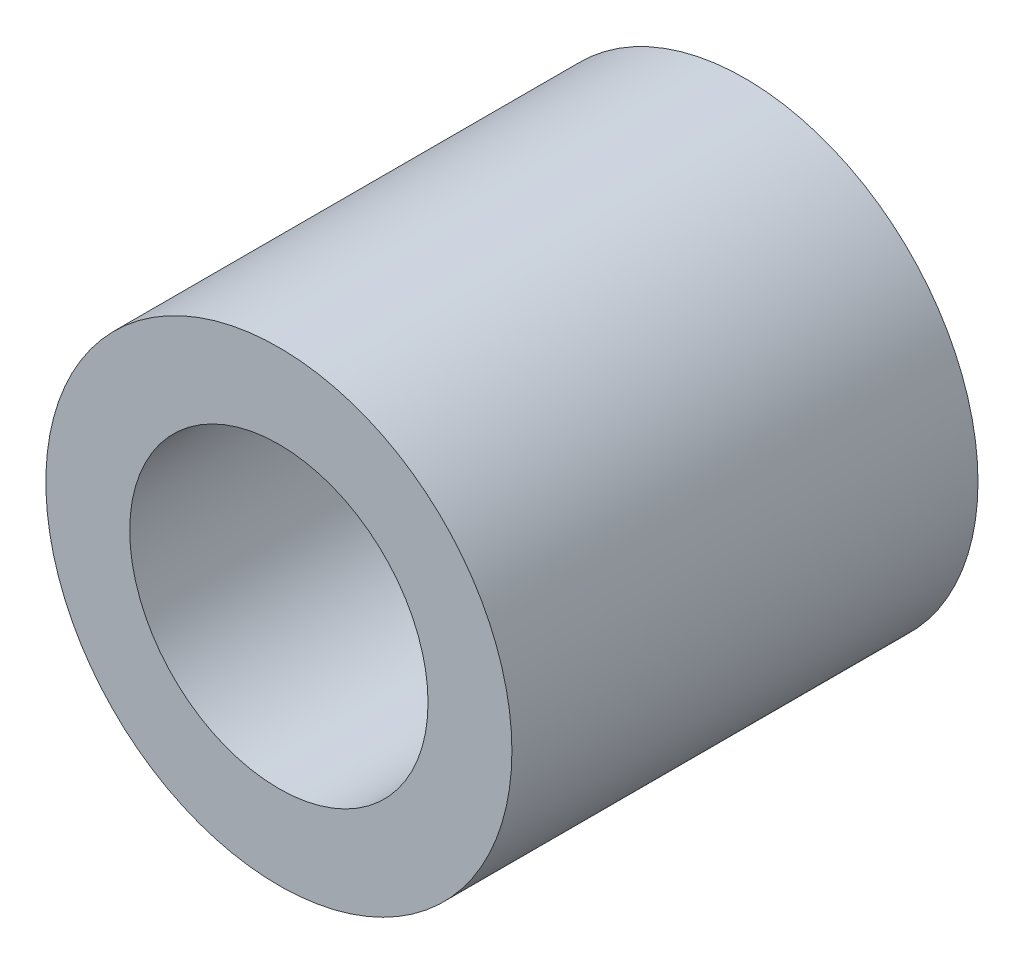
from build123d import *

# Parameters (mm, degrees)
CROQUIS1_R              = 2.5
CROQUIS1_R_2            = 1.6
SALIENTE_EXTRUIR1_DEPTH = 5


with BuildPart() as part:
    # Croquis1 → Saliente-Extruir1 (new body)
    with BuildSketch(Plane.XY):
        Circle(CROQUIS1_R)
        Circle(CROQUIS1_R_2, mode=Mode.SUBTRACT)
    extrude(amount=SALIENTE_EXTRUIR1_DEPTH)


solid = part.part
